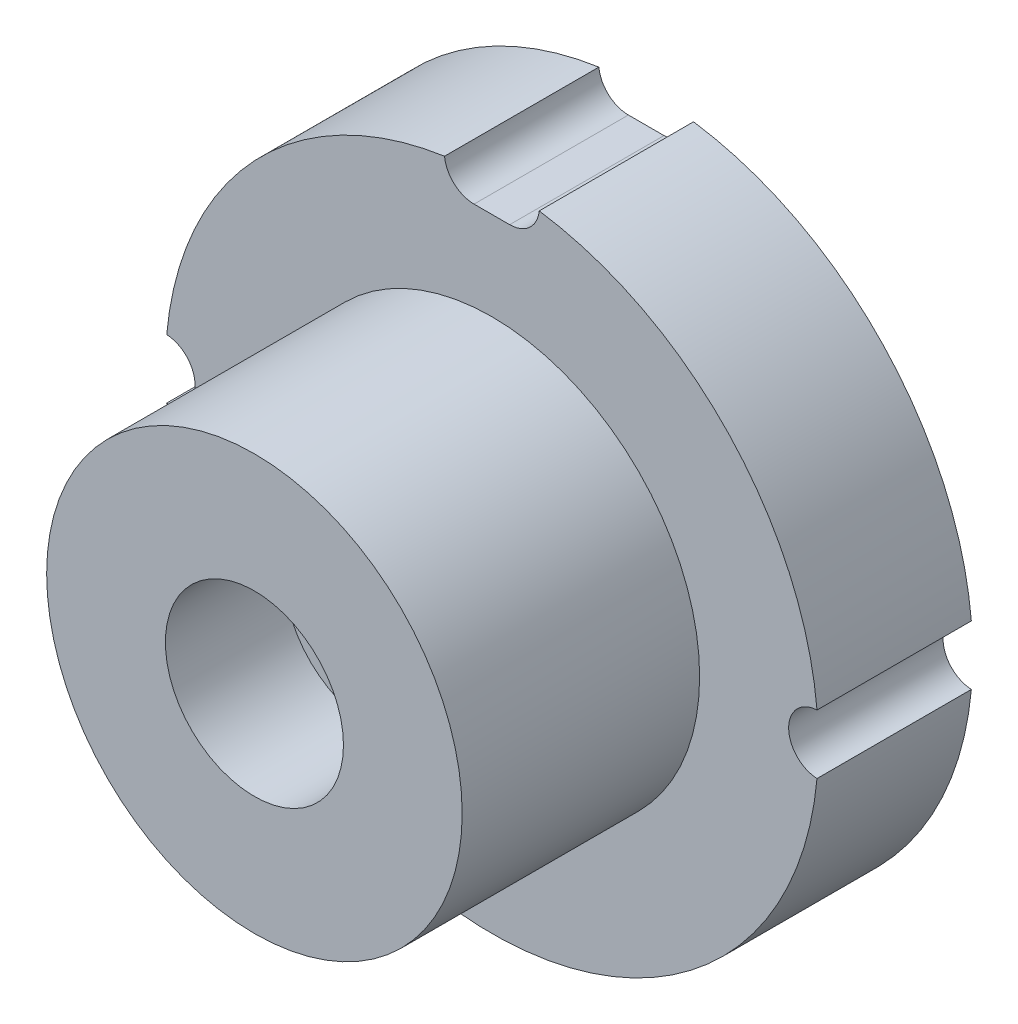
ISO-10303-21;
HEADER;
FILE_DESCRIPTION(('STEP AP214'),'2;1');
FILE_NAME('part.step','',(''),(''),'','','');
FILE_SCHEMA(('AUTOMOTIVE_DESIGN { 1 0 10303 214 1 1 1 1 }'));
ENDSEC;
DATA;
#1=APPLICATION_CONTEXT('core data for automotive mechanical design processes');
#2=APPLICATION_PROTOCOL_DEFINITION('international standard','automotive_design',2000,#1);
#3=PRODUCT_CONTEXT('',#1,'mechanical');
#4=PRODUCT('Part','Part','',(#3));
#5=PRODUCT_RELATED_PRODUCT_CATEGORY('part','',(#4));
#6=PRODUCT_DEFINITION_FORMATION('','',#4);
#7=PRODUCT_DEFINITION_CONTEXT('part definition',#1,'design');
#8=PRODUCT_DEFINITION('design','',#6,#7);
#9=PRODUCT_DEFINITION_SHAPE('','',#8);
#10=(LENGTH_UNIT() NAMED_UNIT(*) SI_UNIT(.MILLI.,.METRE.));
#11=(NAMED_UNIT(*) PLANE_ANGLE_UNIT() SI_UNIT($,.RADIAN.));
#12=(NAMED_UNIT(*) SI_UNIT($,.STERADIAN.) SOLID_ANGLE_UNIT());
#13=UNCERTAINTY_MEASURE_WITH_UNIT(LENGTH_MEASURE(1.E-05),#10,'distance_accuracy_value','');
#14=(GEOMETRIC_REPRESENTATION_CONTEXT(3) GLOBAL_UNCERTAINTY_ASSIGNED_CONTEXT((#13)) GLOBAL_UNIT_ASSIGNED_CONTEXT((#10,
#11,#12)) REPRESENTATION_CONTEXT('',''));
#15=CARTESIAN_POINT('',(0.,0.,0.));
#16=DIRECTION('',(0.,0.,1.));
#17=DIRECTION('',(1.,0.,0.));
#18=AXIS2_PLACEMENT_3D('',#15,#16,#17);
#19=CARTESIAN_POINT('',(0.,0.,1.3));
#20=DIRECTION('',(0.,0.,-1.));
#21=DIRECTION('',(-1.,0.,0.));
#22=AXIS2_PLACEMENT_3D('',#19,#20,#21);
#23=CYLINDRICAL_SURFACE('',#22,2.75);
#24=CARTESIAN_POINT('',(0.,0.,0.));
#25=DIRECTION('',(0.,0.,1.));
#26=DIRECTION('',(1.,0.,0.));
#27=AXIS2_PLACEMENT_3D('',#24,#25,#26);
#28=CIRCLE('',#27,2.75);
#29=CARTESIAN_POINT('',(2.73863636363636,0.249741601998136,0.));
#30=VERTEX_POINT('',#29);
#31=CARTESIAN_POINT('',(0.398749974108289,2.72093705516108,0.));
#32=VERTEX_POINT('',#31);
#33=EDGE_CURVE('E155',#30,#32,#28,.T.);
#34=ORIENTED_EDGE('',*,*,#33,.T.);
#35=DIRECTION('',(0.,0.,-1.));
#36=VECTOR('',#35,1.);
#37=CARTESIAN_POINT('',(0.398749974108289,2.72093705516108,1.65));
#38=LINE('',#37,#36);
#39=CARTESIAN_POINT('',(0.39874997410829,2.72093705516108,1.3));
#40=VERTEX_POINT('',#39);
#41=EDGE_CURVE('E120',#32,#40,#38,.F.);
#42=ORIENTED_EDGE('',*,*,#41,.T.);
#43=CARTESIAN_POINT('',(0.,0.,1.3));
#44=DIRECTION('',(0.,0.,1.));
#45=DIRECTION('',(1.,0.,0.));
#46=AXIS2_PLACEMENT_3D('',#43,#44,#45);
#47=CIRCLE('',#46,2.75);
#48=CARTESIAN_POINT('',(2.73863636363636,0.249741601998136,1.3));
#49=VERTEX_POINT('',#48);
#50=EDGE_CURVE('E159',#49,#40,#47,.T.);
#51=ORIENTED_EDGE('',*,*,#50,.F.);
#52=DIRECTION('',(0.,0.,-1.));
#53=VECTOR('',#52,1.);
#54=CARTESIAN_POINT('',(2.73863636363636,0.249741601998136,1.65));
#55=LINE('',#54,#53);
#56=EDGE_CURVE('E133',#49,#30,#55,.T.);
#57=ORIENTED_EDGE('',*,*,#56,.T.);
#58=EDGE_LOOP('',(#34,#42,#51,#57));
#59=FACE_BOUND('',#58,.T.);
#60=ADVANCED_FACE('F26',(#59),#23,.T.);
#61=CARTESIAN_POINT('',(-0.39874997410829,2.72093705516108,1.3));
#62=VERTEX_POINT('',#61);
#63=CARTESIAN_POINT('',(-2.73863636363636,0.249741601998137,1.3));
#64=VERTEX_POINT('',#63);
#65=EDGE_CURVE('E161',#62,#64,#47,.T.);
#66=ORIENTED_EDGE('',*,*,#65,.F.);
#67=DIRECTION('',(0.,0.,-1.));
#68=VECTOR('',#67,1.);
#69=CARTESIAN_POINT('',(-0.398749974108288,2.72093705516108,0.65));
#70=LINE('',#69,#68);
#71=CARTESIAN_POINT('',(-0.398749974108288,2.72093705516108,0.));
#72=VERTEX_POINT('',#71);
#73=EDGE_CURVE('E116',#62,#72,#70,.T.);
#74=ORIENTED_EDGE('',*,*,#73,.T.);
#75=CARTESIAN_POINT('',(-2.73863636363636,0.249741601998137,0.));
#76=VERTEX_POINT('',#75);
#77=EDGE_CURVE('E49',#72,#76,#28,.T.);
#78=ORIENTED_EDGE('',*,*,#77,.T.);
#79=DIRECTION('',(0.,0.,-1.));
#80=VECTOR('',#79,1.);
#81=CARTESIAN_POINT('',(-2.73863636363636,0.249741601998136,1.65));
#82=LINE('',#81,#80);
#83=EDGE_CURVE('E131',#76,#64,#82,.F.);
#84=ORIENTED_EDGE('',*,*,#83,.T.);
#85=EDGE_LOOP('',(#66,#74,#78,#84));
#86=FACE_BOUND('',#85,.T.);
#87=ADVANCED_FACE('F181',(#86),#23,.T.);
#88=CARTESIAN_POINT('',(0.,0.,1.3));
#89=DIRECTION('',(0.,0.,1.));
#90=DIRECTION('',(1.,0.,0.));
#91=AXIS2_PLACEMENT_3D('',#88,#89,#90);
#92=PLANE('',#91);
#93=CARTESIAN_POINT('',(0.15,2.7459060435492,1.3));
#94=DIRECTION('',(0.,0.,1.));
#95=DIRECTION('',(1.,0.,0.));
#96=AXIS2_PLACEMENT_3D('',#93,#94,#95);
#97=CIRCLE('',#96,0.25);
#98=CARTESIAN_POINT('',(0.15,2.4959060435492,1.3));
#99=VERTEX_POINT('',#98);
#100=EDGE_CURVE('E118',#99,#40,#97,.T.);
#101=ORIENTED_EDGE('',*,*,#100,.F.);
#102=DIRECTION('',(1.,0.,0.));
#103=VECTOR('',#102,1.);
#104=CARTESIAN_POINT('',(0.,2.4959060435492,1.3));
#105=LINE('',#104,#103);
#106=CARTESIAN_POINT('',(-0.15,2.4959060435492,1.3));
#107=VERTEX_POINT('',#106);
#108=EDGE_CURVE('E100',#107,#99,#105,.T.);
#109=ORIENTED_EDGE('',*,*,#108,.F.);
#110=CARTESIAN_POINT('',(-0.15,2.7459060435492,1.3));
#111=DIRECTION('',(0.,0.,1.));
#112=DIRECTION('',(1.,0.,0.));
#113=AXIS2_PLACEMENT_3D('',#110,#111,#112);
#114=CIRCLE('',#113,0.25);
#115=EDGE_CURVE('E98',#62,#107,#114,.T.);
#116=ORIENTED_EDGE('',*,*,#115,.F.);
#117=ORIENTED_EDGE('',*,*,#65,.T.);
#118=CARTESIAN_POINT('',(-2.75,0.,1.3));
#119=DIRECTION('',(0.,0.,1.));
#120=DIRECTION('',(1.,0.,0.));
#121=AXIS2_PLACEMENT_3D('',#118,#119,#120);
#122=CIRCLE('',#121,0.25);
#123=CARTESIAN_POINT('',(-2.73863636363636,-0.249741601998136,1.3));
#124=VERTEX_POINT('',#123);
#125=EDGE_CURVE('E128',#124,#64,#122,.T.);
#126=ORIENTED_EDGE('',*,*,#125,.F.);
#127=CARTESIAN_POINT('',(2.73863636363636,-0.249741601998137,1.3));
#128=VERTEX_POINT('',#127);
#129=EDGE_CURVE('E158',#124,#128,#47,.T.);
#130=ORIENTED_EDGE('',*,*,#129,.T.);
#131=CARTESIAN_POINT('',(2.75,0.,1.3));
#132=DIRECTION('',(0.,0.,1.));
#133=DIRECTION('',(1.,0.,0.));
#134=AXIS2_PLACEMENT_3D('',#131,#132,#133);
#135=CIRCLE('',#134,0.25);
#136=EDGE_CURVE('E136',#49,#128,#135,.T.);
#137=ORIENTED_EDGE('',*,*,#136,.F.);
#138=ORIENTED_EDGE('',*,*,#50,.T.);
#139=EDGE_LOOP('',(#101,#109,#116,#117,#126,#130,#137,#138));
#140=FACE_BOUND('',#139,.T.);
#141=CARTESIAN_POINT('',(0.,0.,1.3));
#142=DIRECTION('',(0.,0.,1.));
#143=DIRECTION('',(1.,0.,0.));
#144=AXIS2_PLACEMENT_3D('',#141,#142,#143);
#145=CIRCLE('',#144,1.75);
#146=CARTESIAN_POINT('',(1.75,0.,1.3));
#147=VERTEX_POINT('',#146);
#148=EDGE_CURVE('E148',#147,#147,#145,.T.);
#149=ORIENTED_EDGE('',*,*,#148,.F.);
#150=EDGE_LOOP('',(#149));
#151=FACE_BOUND('',#150,.T.);
#152=ADVANCED_FACE('F173',(#140,#151),#92,.T.);
#153=ORIENTED_EDGE('',*,*,#129,.F.);
#154=DIRECTION('',(0.,0.,-1.));
#155=VECTOR('',#154,1.);
#156=CARTESIAN_POINT('',(-2.73863636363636,-0.249741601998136,1.65));
#157=LINE('',#156,#155);
#158=CARTESIAN_POINT('',(-2.73863636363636,-0.249741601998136,0.));
#159=VERTEX_POINT('',#158);
#160=EDGE_CURVE('E125',#124,#159,#157,.T.);
#161=ORIENTED_EDGE('',*,*,#160,.T.);
#162=CARTESIAN_POINT('',(2.73863636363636,-0.249741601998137,0.));
#163=VERTEX_POINT('',#162);
#164=EDGE_CURVE('E154',#159,#163,#28,.T.);
#165=ORIENTED_EDGE('',*,*,#164,.T.);
#166=DIRECTION('',(0.,0.,-1.));
#167=VECTOR('',#166,1.);
#168=CARTESIAN_POINT('',(2.73863636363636,-0.249741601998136,1.65));
#169=LINE('',#168,#167);
#170=EDGE_CURVE('E139',#163,#128,#169,.F.);
#171=ORIENTED_EDGE('',*,*,#170,.T.);
#172=EDGE_LOOP('',(#153,#161,#165,#171));
#173=FACE_BOUND('',#172,.T.);
#174=ADVANCED_FACE('F28',(#173),#23,.T.);
#175=CARTESIAN_POINT('',(0.,0.,0.));
#176=DIRECTION('',(0.,0.,1.));
#177=DIRECTION('',(1.,0.,0.));
#178=AXIS2_PLACEMENT_3D('',#175,#176,#177);
#179=PLANE('',#178);
#180=CARTESIAN_POINT('',(0.,1.,0.));
#181=DIRECTION('',(0.,0.,-1.));
#182=DIRECTION('',(-1.,0.,0.));
#183=AXIS2_PLACEMENT_3D('',#180,#181,#182);
#184=CIRCLE('',#183,0.5);
#185=CARTESIAN_POINT('',(-0.5,1.,0.));
#186=VERTEX_POINT('',#185);
#187=EDGE_CURVE('E255',#186,#186,#184,.T.);
#188=ORIENTED_EDGE('',*,*,#187,.F.);
#189=EDGE_LOOP('',(#188));
#190=FACE_BOUND('',#189,.T.);
#191=CARTESIAN_POINT('',(-1.,0.,0.));
#192=DIRECTION('',(0.,0.,-1.));
#193=DIRECTION('',(-1.,0.,0.));
#194=AXIS2_PLACEMENT_3D('',#191,#192,#193);
#195=CIRCLE('',#194,0.5);
#196=CARTESIAN_POINT('',(-1.5,0.,0.));
#197=VERTEX_POINT('',#196);
#198=EDGE_CURVE('E254',#197,#197,#195,.T.);
#199=ORIENTED_EDGE('',*,*,#198,.F.);
#200=EDGE_LOOP('',(#199));
#201=FACE_BOUND('',#200,.T.);
#202=CARTESIAN_POINT('',(1.,0.,0.));
#203=DIRECTION('',(0.,0.,-1.));
#204=DIRECTION('',(-1.,0.,0.));
#205=AXIS2_PLACEMENT_3D('',#202,#203,#204);
#206=CIRCLE('',#205,0.5);
#207=CARTESIAN_POINT('',(0.5,0.,0.));
#208=VERTEX_POINT('',#207);
#209=EDGE_CURVE('E265',#208,#208,#206,.T.);
#210=ORIENTED_EDGE('',*,*,#209,.F.);
#211=EDGE_LOOP('',(#210));
#212=FACE_BOUND('',#211,.T.);
#213=DIRECTION('',(-1.,0.,0.));
#214=VECTOR('',#213,1.);
#215=CARTESIAN_POINT('',(0.15,2.4959060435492,0.));
#216=LINE('',#215,#214);
#217=CARTESIAN_POINT('',(0.15,2.4959060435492,0.));
#218=VERTEX_POINT('',#217);
#219=CARTESIAN_POINT('',(-0.15,2.4959060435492,0.));
#220=VERTEX_POINT('',#219);
#221=EDGE_CURVE('E103',#218,#220,#216,.T.);
#222=ORIENTED_EDGE('',*,*,#221,.F.);
#223=CARTESIAN_POINT('',(0.15,2.7459060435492,0.));
#224=DIRECTION('',(0.,0.,1.));
#225=DIRECTION('',(1.,0.,0.));
#226=AXIS2_PLACEMENT_3D('',#223,#224,#225);
#227=CIRCLE('',#226,0.25);
#228=EDGE_CURVE('E11',#218,#32,#227,.T.);
#229=ORIENTED_EDGE('',*,*,#228,.T.);
#230=ORIENTED_EDGE('',*,*,#33,.F.);
#231=CARTESIAN_POINT('',(2.75,0.,0.));
#232=DIRECTION('',(0.,0.,1.));
#233=DIRECTION('',(1.,0.,0.));
#234=AXIS2_PLACEMENT_3D('',#231,#232,#233);
#235=CIRCLE('',#234,0.25);
#236=EDGE_CURVE('E34',#30,#163,#235,.T.);
#237=ORIENTED_EDGE('',*,*,#236,.T.);
#238=ORIENTED_EDGE('',*,*,#164,.F.);
#239=CARTESIAN_POINT('',(-2.75,0.,0.));
#240=DIRECTION('',(0.,0.,-1.));
#241=DIRECTION('',(-1.,0.,0.));
#242=AXIS2_PLACEMENT_3D('',#239,#240,#241);
#243=CIRCLE('',#242,0.25);
#244=EDGE_CURVE('E123',#76,#159,#243,.T.);
#245=ORIENTED_EDGE('',*,*,#244,.F.);
#246=ORIENTED_EDGE('',*,*,#77,.F.);
#247=CARTESIAN_POINT('',(-0.15,2.7459060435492,0.));
#248=DIRECTION('',(0.,0.,-1.));
#249=DIRECTION('',(-1.,0.,0.));
#250=AXIS2_PLACEMENT_3D('',#247,#248,#249);
#251=CIRCLE('',#250,0.25);
#252=EDGE_CURVE('E96',#220,#72,#251,.T.);
#253=ORIENTED_EDGE('',*,*,#252,.F.);
#254=EDGE_LOOP('',(#222,#229,#230,#237,#238,#245,#246,#253));
#255=FACE_BOUND('',#254,.T.);
#256=ADVANCED_FACE('F108',(#190,#201,#212,#255),#179,.F.);
#257=CARTESIAN_POINT('',(0.,0.,3.3));
#258=DIRECTION('',(0.,0.,-1.));
#259=DIRECTION('',(-1.,0.,0.));
#260=AXIS2_PLACEMENT_3D('',#257,#258,#259);
#261=CYLINDRICAL_SURFACE('',#260,1.75);
#262=CARTESIAN_POINT('',(0.,0.,3.3));
#263=DIRECTION('',(0.,0.,1.));
#264=DIRECTION('',(1.,0.,0.));
#265=AXIS2_PLACEMENT_3D('',#262,#263,#264);
#266=CIRCLE('',#265,1.75);
#267=CARTESIAN_POINT('',(1.75,0.,3.3));
#268=VERTEX_POINT('',#267);
#269=EDGE_CURVE('E151',#268,#268,#266,.T.);
#270=ORIENTED_EDGE('',*,*,#269,.F.);
#271=EDGE_LOOP('',(#270));
#272=FACE_BOUND('',#271,.T.);
#273=ORIENTED_EDGE('',*,*,#148,.T.);
#274=EDGE_LOOP('',(#273));
#275=FACE_BOUND('',#274,.T.);
#276=ADVANCED_FACE('F192',(#272,#275),#261,.T.);
#277=CARTESIAN_POINT('',(0.,0.,3.3));
#278=DIRECTION('',(0.,0.,1.));
#279=DIRECTION('',(1.,0.,0.));
#280=AXIS2_PLACEMENT_3D('',#277,#278,#279);
#281=PLANE('',#280);
#282=CARTESIAN_POINT('',(0.,0.,3.3));
#283=DIRECTION('',(0.,0.,1.));
#284=DIRECTION('',(1.,0.,0.));
#285=AXIS2_PLACEMENT_3D('',#282,#283,#284);
#286=CIRCLE('',#285,0.75);
#287=CARTESIAN_POINT('',(0.75,0.,3.3));
#288=VERTEX_POINT('',#287);
#289=EDGE_CURVE('E142',#288,#288,#286,.T.);
#290=ORIENTED_EDGE('',*,*,#289,.F.);
#291=EDGE_LOOP('',(#290));
#292=FACE_BOUND('',#291,.T.);
#293=ORIENTED_EDGE('',*,*,#269,.T.);
#294=EDGE_LOOP('',(#293));
#295=FACE_BOUND('',#294,.T.);
#296=ADVANCED_FACE('F200',(#292,#295),#281,.T.);
#297=CARTESIAN_POINT('',(0.,0.,2.3));
#298=DIRECTION('',(0.,0.,1.));
#299=DIRECTION('',(1.,0.,0.));
#300=AXIS2_PLACEMENT_3D('',#297,#298,#299);
#301=CYLINDRICAL_SURFACE('',#300,0.75);
#302=CARTESIAN_POINT('',(0.,0.,2.3));
#303=DIRECTION('',(0.,0.,1.));
#304=DIRECTION('',(1.,0.,0.));
#305=AXIS2_PLACEMENT_3D('',#302,#303,#304);
#306=CIRCLE('',#305,0.75);
#307=CARTESIAN_POINT('',(0.75,0.,2.3));
#308=VERTEX_POINT('',#307);
#309=EDGE_CURVE('E145',#308,#308,#306,.T.);
#310=ORIENTED_EDGE('',*,*,#309,.F.);
#311=EDGE_LOOP('',(#310));
#312=FACE_BOUND('',#311,.T.);
#313=ORIENTED_EDGE('',*,*,#289,.T.);
#314=EDGE_LOOP('',(#313));
#315=FACE_BOUND('',#314,.T.);
#316=ADVANCED_FACE('F208',(#312,#315),#301,.F.);
#317=CARTESIAN_POINT('',(0.,0.,2.3));
#318=DIRECTION('',(0.,0.,1.));
#319=DIRECTION('',(1.,0.,0.));
#320=AXIS2_PLACEMENT_3D('',#317,#318,#319);
#321=PLANE('',#320);
#322=ORIENTED_EDGE('',*,*,#309,.T.);
#323=EDGE_LOOP('',(#322));
#324=FACE_BOUND('',#323,.T.);
#325=ADVANCED_FACE('F212',(#324),#321,.T.);
#326=CARTESIAN_POINT('',(2.75,0.,3.3));
#327=DIRECTION('',(0.,0.,-1.));
#328=DIRECTION('',(-1.,0.,0.));
#329=AXIS2_PLACEMENT_3D('',#326,#327,#328);
#330=CYLINDRICAL_SURFACE('',#329,0.25);
#331=ORIENTED_EDGE('',*,*,#236,.F.);
#332=ORIENTED_EDGE('',*,*,#56,.F.);
#333=ORIENTED_EDGE('',*,*,#136,.T.);
#334=ORIENTED_EDGE('',*,*,#170,.F.);
#335=EDGE_LOOP('',(#331,#332,#333,#334));
#336=FACE_BOUND('',#335,.T.);
#337=ADVANCED_FACE('F167',(#336),#330,.F.);
#338=CARTESIAN_POINT('',(-2.75,0.,3.3));
#339=DIRECTION('',(0.,0.,-1.));
#340=DIRECTION('',(-1.,0.,0.));
#341=AXIS2_PLACEMENT_3D('',#338,#339,#340);
#342=CYLINDRICAL_SURFACE('',#341,0.25);
#343=ORIENTED_EDGE('',*,*,#244,.T.);
#344=ORIENTED_EDGE('',*,*,#160,.F.);
#345=ORIENTED_EDGE('',*,*,#125,.T.);
#346=ORIENTED_EDGE('',*,*,#83,.F.);
#347=EDGE_LOOP('',(#343,#344,#345,#346));
#348=FACE_BOUND('',#347,.T.);
#349=ADVANCED_FACE('F179',(#348),#342,.F.);
#350=CARTESIAN_POINT('',(0.15,2.7459060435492,3.3));
#351=DIRECTION('',(0.,0.,-1.));
#352=DIRECTION('',(-1.,0.,0.));
#353=AXIS2_PLACEMENT_3D('',#350,#351,#352);
#354=CYLINDRICAL_SURFACE('',#353,0.25);
#355=ORIENTED_EDGE('',*,*,#228,.F.);
#356=DIRECTION('',(0.,0.,-1.));
#357=VECTOR('',#356,1.);
#358=CARTESIAN_POINT('',(0.15,2.4959060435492,3.3));
#359=LINE('',#358,#357);
#360=EDGE_CURVE('E41',#99,#218,#359,.T.);
#361=ORIENTED_EDGE('',*,*,#360,.F.);
#362=ORIENTED_EDGE('',*,*,#100,.T.);
#363=ORIENTED_EDGE('',*,*,#41,.F.);
#364=EDGE_LOOP('',(#355,#361,#362,#363));
#365=FACE_BOUND('',#364,.T.);
#366=ADVANCED_FACE('F220',(#365),#354,.F.);
#367=CARTESIAN_POINT('',(-0.15,2.7459060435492,3.3));
#368=DIRECTION('',(0.,0.,-1.));
#369=DIRECTION('',(-1.,0.,0.));
#370=AXIS2_PLACEMENT_3D('',#367,#368,#369);
#371=CYLINDRICAL_SURFACE('',#370,0.25);
#372=ORIENTED_EDGE('',*,*,#115,.T.);
#373=DIRECTION('',(0.,0.,-1.));
#374=VECTOR('',#373,1.);
#375=CARTESIAN_POINT('',(-0.15,2.4959060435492,3.3));
#376=LINE('',#375,#374);
#377=EDGE_CURVE('E93',#107,#220,#376,.T.);
#378=ORIENTED_EDGE('',*,*,#377,.T.);
#379=ORIENTED_EDGE('',*,*,#252,.T.);
#380=ORIENTED_EDGE('',*,*,#73,.F.);
#381=EDGE_LOOP('',(#372,#378,#379,#380));
#382=FACE_BOUND('',#381,.T.);
#383=ADVANCED_FACE('F94',(#382),#371,.F.);
#384=CARTESIAN_POINT('',(0.15,2.4959060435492,3.3));
#385=DIRECTION('',(0.,-1.,0.));
#386=DIRECTION('',(0.,0.,-1.));
#387=AXIS2_PLACEMENT_3D('',#384,#385,#386);
#388=PLANE('',#387);
#389=ORIENTED_EDGE('',*,*,#108,.T.);
#390=ORIENTED_EDGE('',*,*,#360,.T.);
#391=ORIENTED_EDGE('',*,*,#221,.T.);
#392=ORIENTED_EDGE('',*,*,#377,.F.);
#393=EDGE_LOOP('',(#389,#390,#391,#392));
#394=FACE_BOUND('',#393,.T.);
#395=ADVANCED_FACE('F104',(#394),#388,.F.);
#396=CARTESIAN_POINT('',(1.,0.,1.));
#397=DIRECTION('',(0.,0.,-1.));
#398=DIRECTION('',(-1.,0.,0.));
#399=AXIS2_PLACEMENT_3D('',#396,#397,#398);
#400=CYLINDRICAL_SURFACE('',#399,0.5);
#401=CARTESIAN_POINT('',(1.,0.,1.));
#402=DIRECTION('',(0.,0.,-1.));
#403=DIRECTION('',(-1.,0.,0.));
#404=AXIS2_PLACEMENT_3D('',#401,#402,#403);
#405=CIRCLE('',#404,0.5);
#406=CARTESIAN_POINT('',(0.5,0.,1.));
#407=VERTEX_POINT('',#406);
#408=EDGE_CURVE('E106',#407,#407,#405,.T.);
#409=ORIENTED_EDGE('',*,*,#408,.F.);
#410=EDGE_LOOP('',(#409));
#411=FACE_BOUND('',#410,.T.);
#412=ORIENTED_EDGE('',*,*,#209,.T.);
#413=EDGE_LOOP('',(#412));
#414=FACE_BOUND('',#413,.T.);
#415=ADVANCED_FACE('F225',(#411,#414),#400,.F.);
#416=CARTESIAN_POINT('',(1.,0.,1.));
#417=DIRECTION('',(0.,0.,-1.));
#418=DIRECTION('',(-1.,0.,0.));
#419=AXIS2_PLACEMENT_3D('',#416,#417,#418);
#420=PLANE('',#419);
#421=ORIENTED_EDGE('',*,*,#408,.T.);
#422=EDGE_LOOP('',(#421));
#423=FACE_BOUND('',#422,.T.);
#424=ADVANCED_FACE('F229',(#423),#420,.T.);
#425=CARTESIAN_POINT('',(-1.,0.,1.));
#426=DIRECTION('',(0.,0.,-1.));
#427=DIRECTION('',(-1.,0.,0.));
#428=AXIS2_PLACEMENT_3D('',#425,#426,#427);
#429=CYLINDRICAL_SURFACE('',#428,0.5);
#430=CARTESIAN_POINT('',(-1.,0.,1.));
#431=DIRECTION('',(0.,0.,-1.));
#432=DIRECTION('',(-1.,0.,0.));
#433=AXIS2_PLACEMENT_3D('',#430,#431,#432);
#434=CIRCLE('',#433,0.5);
#435=CARTESIAN_POINT('',(-1.5,0.,1.));
#436=VERTEX_POINT('',#435);
#437=EDGE_CURVE('E258',#436,#436,#434,.T.);
#438=ORIENTED_EDGE('',*,*,#437,.F.);
#439=EDGE_LOOP('',(#438));
#440=FACE_BOUND('',#439,.T.);
#441=ORIENTED_EDGE('',*,*,#198,.T.);
#442=EDGE_LOOP('',(#441));
#443=FACE_BOUND('',#442,.T.);
#444=ADVANCED_FACE('F233',(#440,#443),#429,.F.);
#445=CARTESIAN_POINT('',(-1.,0.,1.));
#446=DIRECTION('',(0.,0.,-1.));
#447=DIRECTION('',(-1.,0.,0.));
#448=AXIS2_PLACEMENT_3D('',#445,#446,#447);
#449=PLANE('',#448);
#450=ORIENTED_EDGE('',*,*,#437,.T.);
#451=EDGE_LOOP('',(#450));
#452=FACE_BOUND('',#451,.T.);
#453=ADVANCED_FACE('F237',(#452),#449,.T.);
#454=CARTESIAN_POINT('',(0.,1.,1.));
#455=DIRECTION('',(0.,0.,-1.));
#456=DIRECTION('',(-1.,0.,0.));
#457=AXIS2_PLACEMENT_3D('',#454,#455,#456);
#458=CYLINDRICAL_SURFACE('',#457,0.5);
#459=CARTESIAN_POINT('',(0.,1.,1.));
#460=DIRECTION('',(0.,0.,-1.));
#461=DIRECTION('',(-1.,0.,0.));
#462=AXIS2_PLACEMENT_3D('',#459,#460,#461);
#463=CIRCLE('',#462,0.5);
#464=CARTESIAN_POINT('',(-0.5,1.,1.));
#465=VERTEX_POINT('',#464);
#466=EDGE_CURVE('E253',#465,#465,#463,.T.);
#467=ORIENTED_EDGE('',*,*,#466,.F.);
#468=EDGE_LOOP('',(#467));
#469=FACE_BOUND('',#468,.T.);
#470=ORIENTED_EDGE('',*,*,#187,.T.);
#471=EDGE_LOOP('',(#470));
#472=FACE_BOUND('',#471,.T.);
#473=ADVANCED_FACE('F241',(#469,#472),#458,.F.);
#474=CARTESIAN_POINT('',(0.,1.,1.));
#475=DIRECTION('',(0.,0.,-1.));
#476=DIRECTION('',(-1.,0.,0.));
#477=AXIS2_PLACEMENT_3D('',#474,#475,#476);
#478=PLANE('',#477);
#479=ORIENTED_EDGE('',*,*,#466,.T.);
#480=EDGE_LOOP('',(#479));
#481=FACE_BOUND('',#480,.T.);
#482=ADVANCED_FACE('F245',(#481),#478,.T.);
#483=CLOSED_SHELL('',(#60,#87,#152,#174,#256,#276,#296,#316,#325,#337,#349,#366,#383,#395,#415,
#424,#444,#453,#473,#482));
#484=MANIFOLD_SOLID_BREP('B2',#483);
#485=ADVANCED_BREP_SHAPE_REPRESENTATION('',(#18,#484),#14);
#486=SHAPE_DEFINITION_REPRESENTATION(#9,#485);
ENDSEC;
END-ISO-10303-21;
